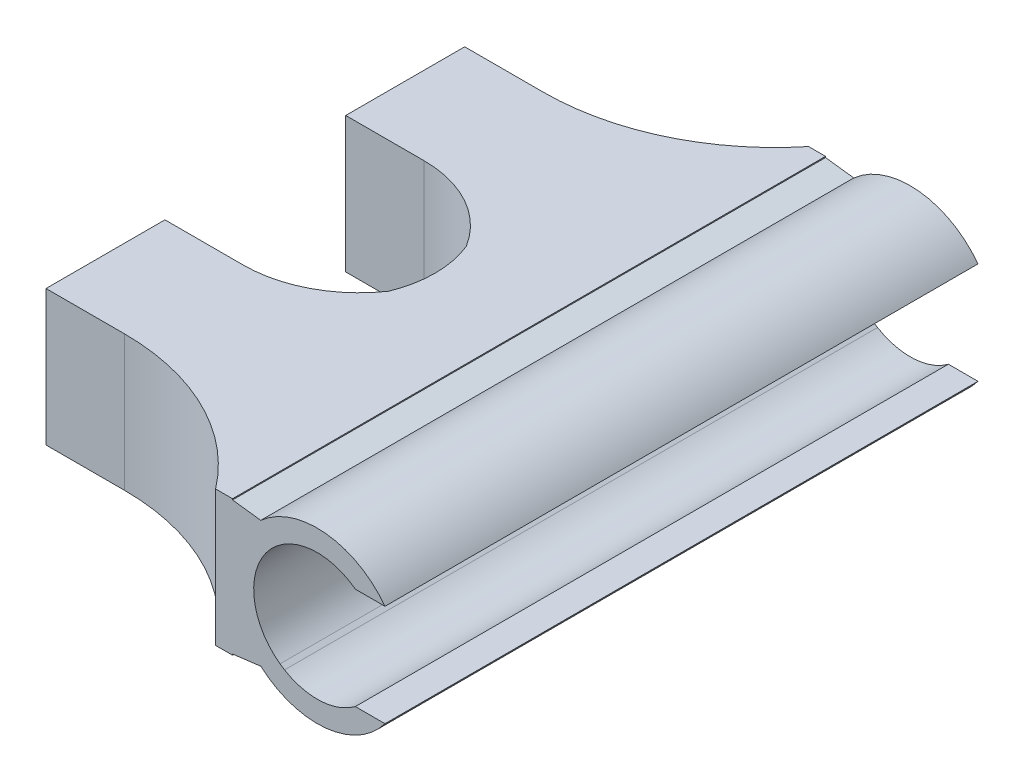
ISO-10303-21;
HEADER;
FILE_DESCRIPTION(('STEP AP214'),'2;1');
FILE_NAME('part.step','',(''),(''),'','','');
FILE_SCHEMA(('AUTOMOTIVE_DESIGN { 1 0 10303 214 1 1 1 1 }'));
ENDSEC;
DATA;
#1=APPLICATION_CONTEXT('core data for automotive mechanical design processes');
#2=APPLICATION_PROTOCOL_DEFINITION('international standard','automotive_design',2000,#1);
#3=PRODUCT_CONTEXT('',#1,'mechanical');
#4=PRODUCT('Part','Part','',(#3));
#5=PRODUCT_RELATED_PRODUCT_CATEGORY('part','',(#4));
#6=PRODUCT_DEFINITION_FORMATION('','',#4);
#7=PRODUCT_DEFINITION_CONTEXT('part definition',#1,'design');
#8=PRODUCT_DEFINITION('design','',#6,#7);
#9=PRODUCT_DEFINITION_SHAPE('','',#8);
#10=(LENGTH_UNIT() NAMED_UNIT(*) SI_UNIT(.MILLI.,.METRE.));
#11=(NAMED_UNIT(*) PLANE_ANGLE_UNIT() SI_UNIT($,.RADIAN.));
#12=(NAMED_UNIT(*) SI_UNIT($,.STERADIAN.) SOLID_ANGLE_UNIT());
#13=UNCERTAINTY_MEASURE_WITH_UNIT(LENGTH_MEASURE(1.E-05),#10,'distance_accuracy_value','');
#14=(GEOMETRIC_REPRESENTATION_CONTEXT(3) GLOBAL_UNCERTAINTY_ASSIGNED_CONTEXT((#13)) GLOBAL_UNIT_ASSIGNED_CONTEXT((#10,
#11,#12)) REPRESENTATION_CONTEXT('',''));
#15=CARTESIAN_POINT('',(0.,0.,0.));
#16=DIRECTION('',(0.,0.,1.));
#17=DIRECTION('',(1.,0.,0.));
#18=AXIS2_PLACEMENT_3D('',#15,#16,#17);
#19=CARTESIAN_POINT('',(-11.,-8.,-17.8885438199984));
#20=DIRECTION('',(0.124034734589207,-0.992277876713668,0.));
#21=DIRECTION('',(0.992277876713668,0.124034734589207,0.));
#22=AXIS2_PLACEMENT_3D('',#19,#20,#21);
#23=PLANE('',#22);
#24=DIRECTION('',(0.992277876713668,0.124034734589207,0.));
#25=VECTOR('',#24,1.);
#26=CARTESIAN_POINT('',(-11.,-8.,70.));
#27=LINE('',#26,#25);
#28=CARTESIAN_POINT('',(-10.,-7.875,70.));
#29=VERTEX_POINT('',#28);
#30=CARTESIAN_POINT('',(-6.66568142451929,-7.45821017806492,70.));
#31=VERTEX_POINT('',#30);
#32=EDGE_CURVE('E269',#29,#31,#27,.T.);
#33=ORIENTED_EDGE('',*,*,#32,.F.);
#34=DIRECTION('',(0.,0.,-1.));
#35=VECTOR('',#34,1.);
#36=CARTESIAN_POINT('',(-10.,-7.875,-17.8885438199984));
#37=LINE('',#36,#35);
#38=CARTESIAN_POINT('',(-10.,-7.875,0.));
#39=VERTEX_POINT('',#38);
#40=EDGE_CURVE('E253',#29,#39,#37,.T.);
#41=ORIENTED_EDGE('',*,*,#40,.T.);
#42=DIRECTION('',(-0.992277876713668,-0.124034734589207,0.));
#43=VECTOR('',#42,1.);
#44=CARTESIAN_POINT('',(-11.,-8.,0.));
#45=LINE('',#44,#43);
#46=CARTESIAN_POINT('',(-6.66568142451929,-7.45821017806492,0.));
#47=VERTEX_POINT('',#46);
#48=EDGE_CURVE('E257',#47,#39,#45,.T.);
#49=ORIENTED_EDGE('',*,*,#48,.F.);
#50=DIRECTION('',(0.,0.,-1.));
#51=VECTOR('',#50,1.);
#52=CARTESIAN_POINT('',(-6.66568142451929,-7.45821017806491,70.));
#53=LINE('',#52,#51);
#54=EDGE_CURVE('E266',#31,#47,#53,.T.);
#55=ORIENTED_EDGE('',*,*,#54,.F.);
#56=EDGE_LOOP('',(#33,#41,#49,#55));
#57=FACE_BOUND('',#56,.T.);
#58=ADVANCED_FACE('F32',(#57),#23,.T.);
#59=CARTESIAN_POINT('',(-3.00000000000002,7.,-17.8885438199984));
#60=DIRECTION('',(0.124034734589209,0.992277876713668,0.));
#61=DIRECTION('',(-0.992277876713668,0.124034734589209,0.));
#62=AXIS2_PLACEMENT_3D('',#59,#60,#61);
#63=PLANE('',#62);
#64=DIRECTION('',(0.992277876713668,-0.124034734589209,0.));
#65=VECTOR('',#64,1.);
#66=CARTESIAN_POINT('',(-3.00000000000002,7.,0.));
#67=LINE('',#66,#65);
#68=CARTESIAN_POINT('',(-10.,7.875,0.));
#69=VERTEX_POINT('',#68);
#70=CARTESIAN_POINT('',(-6.66568142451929,7.45821017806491,0.));
#71=VERTEX_POINT('',#70);
#72=EDGE_CURVE('E264',#69,#71,#67,.T.);
#73=ORIENTED_EDGE('',*,*,#72,.F.);
#74=DIRECTION('',(0.,0.,1.));
#75=VECTOR('',#74,1.);
#76=CARTESIAN_POINT('',(-10.,7.875,-17.8885438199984));
#77=LINE('',#76,#75);
#78=CARTESIAN_POINT('',(-10.,7.875,70.));
#79=VERTEX_POINT('',#78);
#80=EDGE_CURVE('E11',#69,#79,#77,.T.);
#81=ORIENTED_EDGE('',*,*,#80,.T.);
#82=DIRECTION('',(-0.992277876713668,0.124034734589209,0.));
#83=VECTOR('',#82,1.);
#84=CARTESIAN_POINT('',(-3.00000000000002,7.,70.));
#85=LINE('',#84,#83);
#86=CARTESIAN_POINT('',(-6.66568142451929,7.45821017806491,70.));
#87=VERTEX_POINT('',#86);
#88=EDGE_CURVE('E256',#87,#79,#85,.T.);
#89=ORIENTED_EDGE('',*,*,#88,.F.);
#90=DIRECTION('',(0.,0.,-1.));
#91=VECTOR('',#90,1.);
#92=CARTESIAN_POINT('',(-6.66568142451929,7.45821017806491,70.));
#93=LINE('',#92,#91);
#94=EDGE_CURVE('E280',#71,#87,#93,.F.);
#95=ORIENTED_EDGE('',*,*,#94,.F.);
#96=EDGE_LOOP('',(#73,#81,#89,#95));
#97=FACE_BOUND('',#96,.T.);
#98=ADVANCED_FACE('F335',(#97),#63,.T.);
#99=CARTESIAN_POINT('',(-0.00421755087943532,0.,70.));
#100=DIRECTION('',(0.,0.,-1.));
#101=DIRECTION('',(-1.,0.,0.));
#102=AXIS2_PLACEMENT_3D('',#99,#100,#101);
#103=CYLINDRICAL_SURFACE('',#102,7.5);
#104=CARTESIAN_POINT('',(-0.00421755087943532,0.,0.));
#105=DIRECTION('',(0.,0.,-1.));
#106=DIRECTION('',(1.,0.,0.));
#107=AXIS2_PLACEMENT_3D('',#104,#105,#106);
#108=CIRCLE('',#107,7.5);
#109=CARTESIAN_POINT('',(4.49578244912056,-6.,0.));
#110=VERTEX_POINT('',#109);
#111=CARTESIAN_POINT('',(-3.86191590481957,-6.43180871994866,0.));
#112=VERTEX_POINT('',#111);
#113=EDGE_CURVE('E296',#110,#112,#108,.T.);
#114=ORIENTED_EDGE('',*,*,#113,.T.);
#115=DIRECTION('',(0.,0.,-1.));
#116=VECTOR('',#115,1.);
#117=CARTESIAN_POINT('',(-3.86191590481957,-6.43180871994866,70.));
#118=LINE('',#117,#116);
#119=CARTESIAN_POINT('',(-3.86191590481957,-6.43180871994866,70.));
#120=VERTEX_POINT('',#119);
#121=EDGE_CURVE('E278',#112,#120,#118,.F.);
#122=ORIENTED_EDGE('',*,*,#121,.T.);
#123=CARTESIAN_POINT('',(-0.00421755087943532,0.,70.));
#124=DIRECTION('',(0.,0.,-1.));
#125=DIRECTION('',(1.,0.,0.));
#126=AXIS2_PLACEMENT_3D('',#123,#124,#125);
#127=CIRCLE('',#126,7.5);
#128=CARTESIAN_POINT('',(4.49578244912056,-6.,70.));
#129=VERTEX_POINT('',#128);
#130=EDGE_CURVE('E283',#129,#120,#127,.T.);
#131=ORIENTED_EDGE('',*,*,#130,.F.);
#132=DIRECTION('',(0.,0.,-1.));
#133=VECTOR('',#132,1.);
#134=CARTESIAN_POINT('',(4.49578244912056,-6.,70.));
#135=LINE('',#134,#133);
#136=EDGE_CURVE('E295',#129,#110,#135,.T.);
#137=ORIENTED_EDGE('',*,*,#136,.T.);
#138=EDGE_LOOP('',(#114,#122,#131,#137));
#139=FACE_BOUND('',#138,.T.);
#140=ADVANCED_FACE('F348',(#139),#103,.F.);
#141=CARTESIAN_POINT('',(-0.00421755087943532,0.,70.));
#142=DIRECTION('',(0.,0.,-1.));
#143=DIRECTION('',(-1.,0.,0.));
#144=AXIS2_PLACEMENT_3D('',#141,#142,#143);
#145=CYLINDRICAL_SURFACE('',#144,10.);
#146=CARTESIAN_POINT('',(-0.00421755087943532,0.,0.));
#147=DIRECTION('',(0.,0.,1.));
#148=DIRECTION('',(1.,0.,0.));
#149=AXIS2_PLACEMENT_3D('',#146,#147,#148);
#150=CIRCLE('',#149,10.);
#151=CARTESIAN_POINT('',(7.99578244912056,6.,0.));
#152=VERTEX_POINT('',#151);
#153=EDGE_CURVE('E301',#152,#71,#150,.T.);
#154=ORIENTED_EDGE('',*,*,#153,.T.);
#155=ORIENTED_EDGE('',*,*,#94,.T.);
#156=CARTESIAN_POINT('',(-0.00421755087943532,0.,70.));
#157=DIRECTION('',(0.,0.,1.));
#158=DIRECTION('',(1.,0.,0.));
#159=AXIS2_PLACEMENT_3D('',#156,#157,#158);
#160=CIRCLE('',#159,10.);
#161=CARTESIAN_POINT('',(7.99578244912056,6.,70.));
#162=VERTEX_POINT('',#161);
#163=EDGE_CURVE('E290',#162,#87,#160,.T.);
#164=ORIENTED_EDGE('',*,*,#163,.F.);
#165=DIRECTION('',(0.,0.,-1.));
#166=VECTOR('',#165,1.);
#167=CARTESIAN_POINT('',(7.99578244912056,6.,70.));
#168=LINE('',#167,#166);
#169=EDGE_CURVE('E311',#162,#152,#168,.T.);
#170=ORIENTED_EDGE('',*,*,#169,.T.);
#171=EDGE_LOOP('',(#154,#155,#164,#170));
#172=FACE_BOUND('',#171,.T.);
#173=ADVANCED_FACE('F331',(#172),#145,.T.);
#174=CARTESIAN_POINT('',(-4.39485861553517,-6.08048279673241,70.));
#175=VERTEX_POINT('',#174);
#176=CARTESIAN_POINT('',(4.49578244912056,6.,70.));
#177=VERTEX_POINT('',#176);
#178=EDGE_CURVE('E287',#175,#177,#127,.T.);
#179=ORIENTED_EDGE('',*,*,#178,.F.);
#180=DIRECTION('',(0.,0.,-1.));
#181=VECTOR('',#180,1.);
#182=CARTESIAN_POINT('',(-4.39485861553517,-6.08048279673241,70.));
#183=LINE('',#182,#181);
#184=CARTESIAN_POINT('',(-4.39485861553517,-6.08048279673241,0.));
#185=VERTEX_POINT('',#184);
#186=EDGE_CURVE('E275',#175,#185,#183,.T.);
#187=ORIENTED_EDGE('',*,*,#186,.T.);
#188=CARTESIAN_POINT('',(4.49578244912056,6.,0.));
#189=VERTEX_POINT('',#188);
#190=EDGE_CURVE('E282',#185,#189,#108,.T.);
#191=ORIENTED_EDGE('',*,*,#190,.T.);
#192=DIRECTION('',(0.,0.,-1.));
#193=VECTOR('',#192,1.);
#194=CARTESIAN_POINT('',(4.49578244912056,6.,70.));
#195=LINE('',#194,#193);
#196=EDGE_CURVE('E40',#177,#189,#195,.T.);
#197=ORIENTED_EDGE('',*,*,#196,.F.);
#198=EDGE_LOOP('',(#179,#187,#191,#197));
#199=FACE_BOUND('',#198,.T.);
#200=ADVANCED_FACE('F34',(#199),#103,.F.);
#201=CARTESIAN_POINT('',(4.49578244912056,6.,70.));
#202=DIRECTION('',(0.,1.,0.));
#203=DIRECTION('',(-1.,0.,0.));
#204=AXIS2_PLACEMENT_3D('',#201,#202,#203);
#205=PLANE('',#204);
#206=DIRECTION('',(1.,0.,0.));
#207=VECTOR('',#206,1.);
#208=CARTESIAN_POINT('',(4.49578244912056,6.,0.));
#209=LINE('',#208,#207);
#210=EDGE_CURVE('E298',#189,#152,#209,.T.);
#211=ORIENTED_EDGE('',*,*,#210,.T.);
#212=ORIENTED_EDGE('',*,*,#169,.F.);
#213=DIRECTION('',(1.,0.,0.));
#214=VECTOR('',#213,1.);
#215=CARTESIAN_POINT('',(4.49578244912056,6.,70.));
#216=LINE('',#215,#214);
#217=EDGE_CURVE('E286',#177,#162,#216,.T.);
#218=ORIENTED_EDGE('',*,*,#217,.F.);
#219=ORIENTED_EDGE('',*,*,#196,.T.);
#220=EDGE_LOOP('',(#211,#212,#218,#219));
#221=FACE_BOUND('',#220,.T.);
#222=ADVANCED_FACE('F317',(#221),#205,.F.);
#223=CARTESIAN_POINT('',(7.99578244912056,-6.,70.));
#224=VERTEX_POINT('',#223);
#225=EDGE_CURVE('E289',#31,#224,#160,.T.);
#226=ORIENTED_EDGE('',*,*,#225,.F.);
#227=ORIENTED_EDGE('',*,*,#54,.T.);
#228=CARTESIAN_POINT('',(7.99578244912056,-6.,0.));
#229=VERTEX_POINT('',#228);
#230=EDGE_CURVE('E300',#47,#229,#150,.T.);
#231=ORIENTED_EDGE('',*,*,#230,.T.);
#232=DIRECTION('',(0.,0.,-1.));
#233=VECTOR('',#232,1.);
#234=CARTESIAN_POINT('',(7.99578244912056,-6.,70.));
#235=LINE('',#234,#233);
#236=EDGE_CURVE('E308',#224,#229,#235,.T.);
#237=ORIENTED_EDGE('',*,*,#236,.F.);
#238=EDGE_LOOP('',(#226,#227,#231,#237));
#239=FACE_BOUND('',#238,.T.);
#240=ADVANCED_FACE('F356',(#239),#145,.T.);
#241=CARTESIAN_POINT('',(4.49578244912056,-6.,70.));
#242=DIRECTION('',(0.,-1.,0.));
#243=DIRECTION('',(1.,0.,0.));
#244=AXIS2_PLACEMENT_3D('',#241,#242,#243);
#245=PLANE('',#244);
#246=DIRECTION('',(-1.,0.,0.));
#247=VECTOR('',#246,1.);
#248=CARTESIAN_POINT('',(4.49578244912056,-6.,0.));
#249=LINE('',#248,#247);
#250=EDGE_CURVE('E304',#229,#110,#249,.T.);
#251=ORIENTED_EDGE('',*,*,#250,.T.);
#252=ORIENTED_EDGE('',*,*,#136,.F.);
#253=DIRECTION('',(-1.,0.,0.));
#254=VECTOR('',#253,1.);
#255=CARTESIAN_POINT('',(4.49578244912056,-6.,70.));
#256=LINE('',#255,#254);
#257=EDGE_CURVE('E293',#224,#129,#256,.T.);
#258=ORIENTED_EDGE('',*,*,#257,.F.);
#259=ORIENTED_EDGE('',*,*,#236,.T.);
#260=EDGE_LOOP('',(#251,#252,#258,#259));
#261=FACE_BOUND('',#260,.T.);
#262=ADVANCED_FACE('F352',(#261),#245,.F.);
#263=CARTESIAN_POINT('',(-0.00421755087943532,0.,70.));
#264=DIRECTION('',(0.,0.,1.));
#265=DIRECTION('',(1.,0.,0.));
#266=AXIS2_PLACEMENT_3D('',#263,#264,#265);
#267=PLANE('',#266);
#268=DIRECTION('',(0.,1.,0.));
#269=VECTOR('',#268,1.);
#270=CARTESIAN_POINT('',(-10.,-8.,70.));
#271=LINE('',#270,#269);
#272=CARTESIAN_POINT('',(-10.,-8.,70.));
#273=VERTEX_POINT('',#272);
#274=EDGE_CURVE('E244',#273,#29,#271,.T.);
#275=ORIENTED_EDGE('',*,*,#274,.T.);
#276=ORIENTED_EDGE('',*,*,#32,.T.);
#277=ORIENTED_EDGE('',*,*,#225,.T.);
#278=ORIENTED_EDGE('',*,*,#257,.T.);
#279=ORIENTED_EDGE('',*,*,#130,.T.);
#280=DIRECTION('',(-0.834909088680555,0.550387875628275,0.));
#281=VECTOR('',#280,1.);
#282=CARTESIAN_POINT('',(-2.99999999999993,-7.,70.));
#283=LINE('',#282,#281);
#284=EDGE_CURVE('E261',#120,#175,#283,.T.);
#285=ORIENTED_EDGE('',*,*,#284,.T.);
#286=ORIENTED_EDGE('',*,*,#178,.T.);
#287=ORIENTED_EDGE('',*,*,#217,.T.);
#288=ORIENTED_EDGE('',*,*,#163,.T.);
#289=ORIENTED_EDGE('',*,*,#88,.T.);
#290=CARTESIAN_POINT('',(-10.,8.,70.));
#291=VERTEX_POINT('',#290);
#292=EDGE_CURVE('E243',#79,#291,#271,.T.);
#293=ORIENTED_EDGE('',*,*,#292,.T.);
#294=DIRECTION('',(-1.,0.,0.));
#295=VECTOR('',#294,1.);
#296=CARTESIAN_POINT('',(-12.,8.,70.));
#297=LINE('',#296,#295);
#298=CARTESIAN_POINT('',(-12.,8.,70.));
#299=VERTEX_POINT('',#298);
#300=EDGE_CURVE('E403',#291,#299,#297,.T.);
#301=ORIENTED_EDGE('',*,*,#300,.T.);
#302=DIRECTION('',(0.,1.,0.));
#303=VECTOR('',#302,1.);
#304=CARTESIAN_POINT('',(-12.,-8.,70.));
#305=LINE('',#304,#303);
#306=CARTESIAN_POINT('',(-12.,-8.,70.));
#307=VERTEX_POINT('',#306);
#308=EDGE_CURVE('E240',#307,#299,#305,.T.);
#309=ORIENTED_EDGE('',*,*,#308,.F.);
#310=DIRECTION('',(-1.,0.,0.));
#311=VECTOR('',#310,1.);
#312=CARTESIAN_POINT('',(-12.,-8.,70.));
#313=LINE('',#312,#311);
#314=EDGE_CURVE('E366',#273,#307,#313,.T.);
#315=ORIENTED_EDGE('',*,*,#314,.F.);
#316=EDGE_LOOP('',(#275,#276,#277,#278,#279,#285,#286,#287,#288,#289,#293,#301,#309,#315));
#317=FACE_BOUND('',#316,.T.);
#318=ADVANCED_FACE('F338',(#317),#267,.T.);
#319=CARTESIAN_POINT('',(-0.00421755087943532,0.,0.));
#320=DIRECTION('',(0.,0.,1.));
#321=DIRECTION('',(1.,0.,0.));
#322=AXIS2_PLACEMENT_3D('',#319,#320,#321);
#323=PLANE('',#322);
#324=DIRECTION('',(0.,1.,0.));
#325=VECTOR('',#324,1.);
#326=CARTESIAN_POINT('',(-10.,-8.,0.));
#327=LINE('',#326,#325);
#328=CARTESIAN_POINT('',(-10.,-8.,0.));
#329=VERTEX_POINT('',#328);
#330=EDGE_CURVE('E248',#329,#39,#327,.T.);
#331=ORIENTED_EDGE('',*,*,#330,.F.);
#332=DIRECTION('',(1.,0.,0.));
#333=VECTOR('',#332,1.);
#334=CARTESIAN_POINT('',(-10.,-8.,0.));
#335=LINE('',#334,#333);
#336=CARTESIAN_POINT('',(-12.,-8.,0.));
#337=VERTEX_POINT('',#336);
#338=EDGE_CURVE('E375',#337,#329,#335,.T.);
#339=ORIENTED_EDGE('',*,*,#338,.F.);
#340=DIRECTION('',(0.,1.,0.));
#341=VECTOR('',#340,1.);
#342=CARTESIAN_POINT('',(-12.,-8.,0.));
#343=LINE('',#342,#341);
#344=CARTESIAN_POINT('',(-12.,8.,0.));
#345=VERTEX_POINT('',#344);
#346=EDGE_CURVE('E250',#337,#345,#343,.T.);
#347=ORIENTED_EDGE('',*,*,#346,.T.);
#348=DIRECTION('',(1.,0.,0.));
#349=VECTOR('',#348,1.);
#350=CARTESIAN_POINT('',(-10.,8.,0.));
#351=LINE('',#350,#349);
#352=CARTESIAN_POINT('',(-10.,8.,0.));
#353=VERTEX_POINT('',#352);
#354=EDGE_CURVE('E398',#345,#353,#351,.T.);
#355=ORIENTED_EDGE('',*,*,#354,.T.);
#356=EDGE_CURVE('E247',#69,#353,#327,.T.);
#357=ORIENTED_EDGE('',*,*,#356,.F.);
#358=ORIENTED_EDGE('',*,*,#72,.T.);
#359=ORIENTED_EDGE('',*,*,#153,.F.);
#360=ORIENTED_EDGE('',*,*,#210,.F.);
#361=ORIENTED_EDGE('',*,*,#190,.F.);
#362=DIRECTION('',(0.834909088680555,-0.550387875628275,0.));
#363=VECTOR('',#362,1.);
#364=CARTESIAN_POINT('',(-2.99999999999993,-7.,0.));
#365=LINE('',#364,#363);
#366=EDGE_CURVE('E260',#185,#112,#365,.T.);
#367=ORIENTED_EDGE('',*,*,#366,.T.);
#368=ORIENTED_EDGE('',*,*,#113,.F.);
#369=ORIENTED_EDGE('',*,*,#250,.F.);
#370=ORIENTED_EDGE('',*,*,#230,.F.);
#371=ORIENTED_EDGE('',*,*,#48,.T.);
#372=EDGE_LOOP('',(#331,#339,#347,#355,#357,#358,#359,#360,#361,#367,#368,#369,#370,#371));
#373=FACE_BOUND('',#372,.T.);
#374=ADVANCED_FACE('F326',(#373),#323,.F.);
#375=CARTESIAN_POINT('',(-2.99999999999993,-7.,-17.8885438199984));
#376=DIRECTION('',(0.550387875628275,0.834909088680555,0.));
#377=DIRECTION('',(-0.834909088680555,0.550387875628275,0.));
#378=AXIS2_PLACEMENT_3D('',#375,#376,#377);
#379=PLANE('',#378);
#380=ORIENTED_EDGE('',*,*,#121,.F.);
#381=ORIENTED_EDGE('',*,*,#366,.F.);
#382=ORIENTED_EDGE('',*,*,#186,.F.);
#383=ORIENTED_EDGE('',*,*,#284,.F.);
#384=EDGE_LOOP('',(#380,#381,#382,#383));
#385=FACE_BOUND('',#384,.T.);
#386=ADVANCED_FACE('F344',(#385),#379,.T.);
#387=CARTESIAN_POINT('',(-33.2500009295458,-8.,-17.3045811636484));
#388=DIRECTION('',(0.,1.,0.));
#389=DIRECTION('',(0.,0.,1.));
#390=AXIS2_PLACEMENT_3D('',#387,#388,#389);
#391=PLANE('',#390);
#392=DIRECTION('',(-1.,0.,0.));
#393=VECTOR('',#392,1.);
#394=CARTESIAN_POINT('',(-44.4800018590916,-8.,24.14));
#395=LINE('',#394,#393);
#396=CARTESIAN_POINT('',(-33.2500009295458,-8.,24.14));
#397=VERTEX_POINT('',#396);
#398=CARTESIAN_POINT('',(-42.5000018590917,-8.,24.14));
#399=VERTEX_POINT('',#398);
#400=EDGE_CURVE('E392',#397,#399,#395,.T.);
#401=ORIENTED_EDGE('',*,*,#400,.T.);
#402=DIRECTION('',(0.,0.,1.));
#403=VECTOR('',#402,1.);
#404=CARTESIAN_POINT('',(-42.5000018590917,-8.,24.14));
#405=LINE('',#404,#403);
#406=CARTESIAN_POINT('',(-42.5000018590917,-8.,10.1));
#407=VERTEX_POINT('',#406);
#408=EDGE_CURVE('E194',#407,#399,#405,.T.);
#409=ORIENTED_EDGE('',*,*,#408,.F.);
#410=DIRECTION('',(1.,0.,0.));
#411=VECTOR('',#410,1.);
#412=CARTESIAN_POINT('',(-54.5000018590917,-8.,10.1));
#413=LINE('',#412,#411);
#414=CARTESIAN_POINT('',(-33.2500009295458,-8.,10.1));
#415=VERTEX_POINT('',#414);
#416=EDGE_CURVE('E226',#407,#415,#413,.T.);
#417=ORIENTED_EDGE('',*,*,#416,.T.);
#418=CARTESIAN_POINT('',(-33.2500009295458,-8.,-17.3045811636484));
#419=DIRECTION('',(0.,1.,0.));
#420=DIRECTION('',(0.,0.,1.));
#421=AXIS2_PLACEMENT_3D('',#418,#419,#420);
#422=CIRCLE('',#421,27.4045811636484);
#423=EDGE_CURVE('E217',#415,#337,#422,.T.);
#424=ORIENTED_EDGE('',*,*,#423,.T.);
#425=ORIENTED_EDGE('',*,*,#338,.T.);
#426=DIRECTION('',(0.,0.,1.));
#427=VECTOR('',#426,1.);
#428=CARTESIAN_POINT('',(-10.,-8.,70.));
#429=LINE('',#428,#427);
#430=EDGE_CURVE('E371',#329,#273,#429,.T.);
#431=ORIENTED_EDGE('',*,*,#430,.T.);
#432=ORIENTED_EDGE('',*,*,#314,.T.);
#433=CARTESIAN_POINT('',(-33.2500009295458,-8.,86.304014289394));
#434=DIRECTION('',(0.,1.,0.));
#435=DIRECTION('',(0.,0.,-1.));
#436=AXIS2_PLACEMENT_3D('',#433,#434,#435);
#437=CIRCLE('',#436,26.784014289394);
#438=CARTESIAN_POINT('',(-33.2500009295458,-8.,59.52));
#439=VERTEX_POINT('',#438);
#440=EDGE_CURVE('E370',#307,#439,#437,.T.);
#441=ORIENTED_EDGE('',*,*,#440,.T.);
#442=DIRECTION('',(-1.,0.,0.));
#443=VECTOR('',#442,1.);
#444=CARTESIAN_POINT('',(-44.48,-8.,59.52));
#445=LINE('',#444,#443);
#446=CARTESIAN_POINT('',(-42.5000018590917,-8.,59.52));
#447=VERTEX_POINT('',#446);
#448=EDGE_CURVE('E381',#439,#447,#445,.T.);
#449=ORIENTED_EDGE('',*,*,#448,.T.);
#450=DIRECTION('',(0.,0.,1.));
#451=VECTOR('',#450,1.);
#452=CARTESIAN_POINT('',(-42.5000018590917,-8.,45.48));
#453=LINE('',#452,#451);
#454=CARTESIAN_POINT('',(-42.5000018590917,-8.,45.48));
#455=VERTEX_POINT('',#454);
#456=EDGE_CURVE('E199',#455,#447,#453,.T.);
#457=ORIENTED_EDGE('',*,*,#456,.F.);
#458=DIRECTION('',(1.,0.,0.));
#459=VECTOR('',#458,1.);
#460=CARTESIAN_POINT('',(-54.5,-8.,45.48));
#461=LINE('',#460,#459);
#462=CARTESIAN_POINT('',(-33.2500009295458,-8.,45.48));
#463=VERTEX_POINT('',#462);
#464=EDGE_CURVE('E384',#455,#463,#461,.T.);
#465=ORIENTED_EDGE('',*,*,#464,.T.);
#466=CARTESIAN_POINT('',(-33.2500009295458,-8.,31.797072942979));
#467=DIRECTION('',(0.,1.,0.));
#468=DIRECTION('',(0.,0.,1.));
#469=AXIS2_PLACEMENT_3D('',#466,#467,#468);
#470=CIRCLE('',#469,13.682927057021);
#471=CARTESIAN_POINT('',(-22.0000000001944,-8.,39.5855241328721));
#472=VERTEX_POINT('',#471);
#473=EDGE_CURVE('E386',#463,#472,#470,.T.);
#474=ORIENTED_EDGE('',*,*,#473,.T.);
#475=CARTESIAN_POINT('',(-33.25,-8.,35.));
#476=DIRECTION('',(0.,1.,0.));
#477=DIRECTION('',(0.,0.,-1.));
#478=AXIS2_PLACEMENT_3D('',#475,#476,#477);
#479=CIRCLE('',#478,12.1486431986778);
#480=CARTESIAN_POINT('',(-21.9999999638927,-8.,30.4144759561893));
#481=VERTEX_POINT('',#480);
#482=EDGE_CURVE('E388',#472,#481,#479,.T.);
#483=ORIENTED_EDGE('',*,*,#482,.T.);
#484=CARTESIAN_POINT('',(-33.2500009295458,-8.,37.362743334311));
#485=DIRECTION('',(0.,1.,0.));
#486=DIRECTION('',(0.,0.,-1.));
#487=AXIS2_PLACEMENT_3D('',#484,#485,#486);
#488=CIRCLE('',#487,13.222743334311);
#489=EDGE_CURVE('E390',#481,#397,#488,.T.);
#490=ORIENTED_EDGE('',*,*,#489,.T.);
#491=EDGE_LOOP('',(#401,#409,#417,#424,#425,#431,#432,#441,#449,#457,#465,#474,#483,#490));
#492=FACE_BOUND('',#491,.T.);
#493=ADVANCED_FACE('F373',(#492),#391,.F.);
#494=CARTESIAN_POINT('',(-10.,-8.,70.));
#495=DIRECTION('',(-1.,0.,0.));
#496=DIRECTION('',(0.,0.,1.));
#497=AXIS2_PLACEMENT_3D('',#494,#495,#496);
#498=PLANE('',#497);
#499=ORIENTED_EDGE('',*,*,#40,.F.);
#500=ORIENTED_EDGE('',*,*,#274,.F.);
#501=ORIENTED_EDGE('',*,*,#430,.F.);
#502=ORIENTED_EDGE('',*,*,#330,.T.);
#503=EDGE_LOOP('',(#499,#500,#501,#502));
#504=FACE_BOUND('',#503,.T.);
#505=ADVANCED_FACE('F364',(#504),#498,.F.);
#506=CARTESIAN_POINT('',(-33.2500009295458,8.,-17.3045811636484));
#507=DIRECTION('',(0.,1.,0.));
#508=DIRECTION('',(0.,0.,1.));
#509=AXIS2_PLACEMENT_3D('',#506,#507,#508);
#510=PLANE('',#509);
#511=DIRECTION('',(0.,0.,1.));
#512=VECTOR('',#511,1.);
#513=CARTESIAN_POINT('',(-42.5000018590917,8.,24.14));
#514=LINE('',#513,#512);
#515=CARTESIAN_POINT('',(-42.5000018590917,8.,10.1));
#516=VERTEX_POINT('',#515);
#517=CARTESIAN_POINT('',(-42.5000018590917,8.,24.14));
#518=VERTEX_POINT('',#517);
#519=EDGE_CURVE('E47',#516,#518,#514,.T.);
#520=ORIENTED_EDGE('',*,*,#519,.T.);
#521=DIRECTION('',(-1.,0.,0.));
#522=VECTOR('',#521,1.);
#523=CARTESIAN_POINT('',(-54.5000018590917,8.,24.14));
#524=LINE('',#523,#522);
#525=CARTESIAN_POINT('',(-33.2500009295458,8.,24.14));
#526=VERTEX_POINT('',#525);
#527=EDGE_CURVE('E206',#526,#518,#524,.T.);
#528=ORIENTED_EDGE('',*,*,#527,.F.);
#529=CARTESIAN_POINT('',(-33.2500009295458,8.,37.362743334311));
#530=DIRECTION('',(0.,1.,0.));
#531=DIRECTION('',(0.,0.,-1.));
#532=AXIS2_PLACEMENT_3D('',#529,#530,#531);
#533=CIRCLE('',#532,13.222743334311);
#534=CARTESIAN_POINT('',(-21.9999999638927,8.,30.4144759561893));
#535=VERTEX_POINT('',#534);
#536=EDGE_CURVE('E215',#535,#526,#533,.T.);
#537=ORIENTED_EDGE('',*,*,#536,.F.);
#538=CARTESIAN_POINT('',(-33.25,8.,35.));
#539=DIRECTION('',(0.,1.,0.));
#540=DIRECTION('',(0.,0.,-1.));
#541=AXIS2_PLACEMENT_3D('',#538,#539,#540);
#542=CIRCLE('',#541,12.1486431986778);
#543=CARTESIAN_POINT('',(-22.0000000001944,8.,39.5855241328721));
#544=VERTEX_POINT('',#543);
#545=EDGE_CURVE('E219',#544,#535,#542,.T.);
#546=ORIENTED_EDGE('',*,*,#545,.F.);
#547=CARTESIAN_POINT('',(-33.2500009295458,8.,31.797072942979));
#548=DIRECTION('',(0.,1.,0.));
#549=DIRECTION('',(0.,0.,1.));
#550=AXIS2_PLACEMENT_3D('',#547,#548,#549);
#551=CIRCLE('',#550,13.682927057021);
#552=CARTESIAN_POINT('',(-33.2500009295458,8.,45.48));
#553=VERTEX_POINT('',#552);
#554=EDGE_CURVE('E413',#553,#544,#551,.T.);
#555=ORIENTED_EDGE('',*,*,#554,.F.);
#556=DIRECTION('',(1.,0.,0.));
#557=VECTOR('',#556,1.);
#558=CARTESIAN_POINT('',(-44.48,8.,45.48));
#559=LINE('',#558,#557);
#560=CARTESIAN_POINT('',(-42.5000018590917,8.,45.48));
#561=VERTEX_POINT('',#560);
#562=EDGE_CURVE('E411',#561,#553,#559,.T.);
#563=ORIENTED_EDGE('',*,*,#562,.F.);
#564=DIRECTION('',(0.,0.,1.));
#565=VECTOR('',#564,1.);
#566=CARTESIAN_POINT('',(-42.5000018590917,8.,45.48));
#567=LINE('',#566,#565);
#568=CARTESIAN_POINT('',(-42.5000018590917,8.,59.52));
#569=VERTEX_POINT('',#568);
#570=EDGE_CURVE('E55',#561,#569,#567,.T.);
#571=ORIENTED_EDGE('',*,*,#570,.T.);
#572=DIRECTION('',(-1.,0.,0.));
#573=VECTOR('',#572,1.);
#574=CARTESIAN_POINT('',(-54.5,8.,59.52));
#575=LINE('',#574,#573);
#576=CARTESIAN_POINT('',(-33.2500009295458,8.,59.52));
#577=VERTEX_POINT('',#576);
#578=EDGE_CURVE('E408',#577,#569,#575,.T.);
#579=ORIENTED_EDGE('',*,*,#578,.F.);
#580=CARTESIAN_POINT('',(-33.2500009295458,8.,86.304014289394));
#581=DIRECTION('',(0.,1.,0.));
#582=DIRECTION('',(0.,0.,-1.));
#583=AXIS2_PLACEMENT_3D('',#580,#581,#582);
#584=CIRCLE('',#583,26.784014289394);
#585=EDGE_CURVE('E405',#299,#577,#584,.T.);
#586=ORIENTED_EDGE('',*,*,#585,.F.);
#587=ORIENTED_EDGE('',*,*,#300,.F.);
#588=DIRECTION('',(0.,0.,1.));
#589=VECTOR('',#588,1.);
#590=CARTESIAN_POINT('',(-10.,8.,70.));
#591=LINE('',#590,#589);
#592=EDGE_CURVE('E401',#353,#291,#591,.T.);
#593=ORIENTED_EDGE('',*,*,#592,.F.);
#594=ORIENTED_EDGE('',*,*,#354,.F.);
#595=CARTESIAN_POINT('',(-33.2500009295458,8.,-17.3045811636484));
#596=DIRECTION('',(0.,1.,0.));
#597=DIRECTION('',(0.,0.,1.));
#598=AXIS2_PLACEMENT_3D('',#595,#596,#597);
#599=CIRCLE('',#598,27.4045811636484);
#600=CARTESIAN_POINT('',(-33.2500009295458,8.,10.1));
#601=VERTEX_POINT('',#600);
#602=EDGE_CURVE('E395',#601,#345,#599,.T.);
#603=ORIENTED_EDGE('',*,*,#602,.F.);
#604=DIRECTION('',(1.,0.,0.));
#605=VECTOR('',#604,1.);
#606=CARTESIAN_POINT('',(-44.5583859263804,8.,10.1));
#607=LINE('',#606,#605);
#608=EDGE_CURVE('E209',#516,#601,#607,.T.);
#609=ORIENTED_EDGE('',*,*,#608,.F.);
#610=EDGE_LOOP('',(#520,#528,#537,#546,#555,#563,#571,#579,#586,#587,#593,#594,#603,#609));
#611=FACE_BOUND('',#610,.T.);
#612=ADVANCED_FACE('F204',(#611),#510,.T.);
#613=CARTESIAN_POINT('',(-33.2500009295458,-8.,-17.3045811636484));
#614=DIRECTION('',(0.,1.,0.));
#615=DIRECTION('',(0.,0.,1.));
#616=AXIS2_PLACEMENT_3D('',#613,#614,#615);
#617=CYLINDRICAL_SURFACE('',#616,27.4045811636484);
#618=ORIENTED_EDGE('',*,*,#602,.T.);
#619=ORIENTED_EDGE('',*,*,#346,.F.);
#620=ORIENTED_EDGE('',*,*,#423,.F.);
#621=DIRECTION('',(0.,1.,0.));
#622=VECTOR('',#621,1.);
#623=CARTESIAN_POINT('',(-33.2500009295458,-8.,10.1));
#624=LINE('',#623,#622);
#625=EDGE_CURVE('E223',#415,#601,#624,.T.);
#626=ORIENTED_EDGE('',*,*,#625,.T.);
#627=EDGE_LOOP('',(#618,#619,#620,#626));
#628=FACE_BOUND('',#627,.T.);
#629=ADVANCED_FACE('F444',(#628),#617,.F.);
#630=ORIENTED_EDGE('',*,*,#80,.F.);
#631=ORIENTED_EDGE('',*,*,#356,.T.);
#632=ORIENTED_EDGE('',*,*,#592,.T.);
#633=ORIENTED_EDGE('',*,*,#292,.F.);
#634=EDGE_LOOP('',(#630,#631,#632,#633));
#635=FACE_BOUND('',#634,.T.);
#636=ADVANCED_FACE('F448',(#635),#498,.F.);
#637=CARTESIAN_POINT('',(-33.2500009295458,-8.,86.304014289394));
#638=DIRECTION('',(0.,1.,0.));
#639=DIRECTION('',(0.,0.,1.));
#640=AXIS2_PLACEMENT_3D('',#637,#638,#639);
#641=CYLINDRICAL_SURFACE('',#640,26.784014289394);
#642=ORIENTED_EDGE('',*,*,#585,.T.);
#643=DIRECTION('',(0.,1.,0.));
#644=VECTOR('',#643,1.);
#645=CARTESIAN_POINT('',(-33.2500009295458,-8.,59.52));
#646=LINE('',#645,#644);
#647=EDGE_CURVE('E237',#439,#577,#646,.T.);
#648=ORIENTED_EDGE('',*,*,#647,.F.);
#649=ORIENTED_EDGE('',*,*,#440,.F.);
#650=ORIENTED_EDGE('',*,*,#308,.T.);
#651=EDGE_LOOP('',(#642,#648,#649,#650));
#652=FACE_BOUND('',#651,.T.);
#653=ADVANCED_FACE('F451',(#652),#641,.F.);
#654=CARTESIAN_POINT('',(-54.5,-8.,59.52));
#655=DIRECTION('',(0.,0.,-1.));
#656=DIRECTION('',(-1.,0.,0.));
#657=AXIS2_PLACEMENT_3D('',#654,#655,#656);
#658=PLANE('',#657);
#659=ORIENTED_EDGE('',*,*,#578,.T.);
#660=DIRECTION('',(0.,-1.,0.));
#661=VECTOR('',#660,1.);
#662=CARTESIAN_POINT('',(-42.5000018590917,8.,59.52));
#663=LINE('',#662,#661);
#664=EDGE_CURVE('E399',#569,#447,#663,.T.);
#665=ORIENTED_EDGE('',*,*,#664,.T.);
#666=ORIENTED_EDGE('',*,*,#448,.F.);
#667=ORIENTED_EDGE('',*,*,#647,.T.);
#668=EDGE_LOOP('',(#659,#665,#666,#667));
#669=FACE_BOUND('',#668,.T.);
#670=ADVANCED_FACE('F455',(#669),#658,.F.);
#671=CARTESIAN_POINT('',(-44.48,-8.,45.48));
#672=DIRECTION('',(0.,0.,1.));
#673=DIRECTION('',(1.,0.,0.));
#674=AXIS2_PLACEMENT_3D('',#671,#672,#673);
#675=PLANE('',#674);
#676=ORIENTED_EDGE('',*,*,#464,.F.);
#677=DIRECTION('',(0.,-1.,0.));
#678=VECTOR('',#677,1.);
#679=CARTESIAN_POINT('',(-42.5000018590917,8.,45.48));
#680=LINE('',#679,#678);
#681=EDGE_CURVE('E433',#561,#455,#680,.T.);
#682=ORIENTED_EDGE('',*,*,#681,.F.);
#683=ORIENTED_EDGE('',*,*,#562,.T.);
#684=DIRECTION('',(0.,1.,0.));
#685=VECTOR('',#684,1.);
#686=CARTESIAN_POINT('',(-33.2500009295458,-8.,45.48));
#687=LINE('',#686,#685);
#688=EDGE_CURVE('E234',#463,#553,#687,.T.);
#689=ORIENTED_EDGE('',*,*,#688,.F.);
#690=EDGE_LOOP('',(#676,#682,#683,#689));
#691=FACE_BOUND('',#690,.T.);
#692=ADVANCED_FACE('F432',(#691),#675,.F.);
#693=CARTESIAN_POINT('',(-33.2500009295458,-8.,31.797072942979));
#694=DIRECTION('',(0.,1.,0.));
#695=DIRECTION('',(0.,0.,1.));
#696=AXIS2_PLACEMENT_3D('',#693,#694,#695);
#697=CYLINDRICAL_SURFACE('',#696,13.682927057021);
#698=ORIENTED_EDGE('',*,*,#554,.T.);
#699=DIRECTION('',(0.,1.,0.));
#700=VECTOR('',#699,1.);
#701=CARTESIAN_POINT('',(-22.0000000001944,-8.,39.5855241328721));
#702=LINE('',#701,#700);
#703=EDGE_CURVE('E231',#472,#544,#702,.T.);
#704=ORIENTED_EDGE('',*,*,#703,.F.);
#705=ORIENTED_EDGE('',*,*,#473,.F.);
#706=ORIENTED_EDGE('',*,*,#688,.T.);
#707=EDGE_LOOP('',(#698,#704,#705,#706));
#708=FACE_BOUND('',#707,.T.);
#709=ADVANCED_FACE('F429',(#708),#697,.F.);
#710=CARTESIAN_POINT('',(-33.25,-8.,35.));
#711=DIRECTION('',(0.,1.,0.));
#712=DIRECTION('',(0.,0.,1.));
#713=AXIS2_PLACEMENT_3D('',#710,#711,#712);
#714=CYLINDRICAL_SURFACE('',#713,12.1486431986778);
#715=ORIENTED_EDGE('',*,*,#545,.T.);
#716=DIRECTION('',(0.,1.,0.));
#717=VECTOR('',#716,1.);
#718=CARTESIAN_POINT('',(-21.9999999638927,-8.,30.4144759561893));
#719=LINE('',#718,#717);
#720=EDGE_CURVE('E228',#481,#535,#719,.T.);
#721=ORIENTED_EDGE('',*,*,#720,.F.);
#722=ORIENTED_EDGE('',*,*,#482,.F.);
#723=ORIENTED_EDGE('',*,*,#703,.T.);
#724=EDGE_LOOP('',(#715,#721,#722,#723));
#725=FACE_BOUND('',#724,.T.);
#726=ADVANCED_FACE('F417',(#725),#714,.F.);
#727=CARTESIAN_POINT('',(-33.2500009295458,-8.,37.362743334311));
#728=DIRECTION('',(0.,1.,0.));
#729=DIRECTION('',(0.,0.,1.));
#730=AXIS2_PLACEMENT_3D('',#727,#728,#729);
#731=CYLINDRICAL_SURFACE('',#730,13.222743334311);
#732=ORIENTED_EDGE('',*,*,#536,.T.);
#733=DIRECTION('',(0.,1.,0.));
#734=VECTOR('',#733,1.);
#735=CARTESIAN_POINT('',(-33.2500009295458,-8.,24.14));
#736=LINE('',#735,#734);
#737=EDGE_CURVE('E214',#397,#526,#736,.T.);
#738=ORIENTED_EDGE('',*,*,#737,.F.);
#739=ORIENTED_EDGE('',*,*,#489,.F.);
#740=ORIENTED_EDGE('',*,*,#720,.T.);
#741=EDGE_LOOP('',(#732,#738,#739,#740));
#742=FACE_BOUND('',#741,.T.);
#743=ADVANCED_FACE('F423',(#742),#731,.F.);
#744=CARTESIAN_POINT('',(-54.5000018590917,-8.,24.14));
#745=DIRECTION('',(0.,0.,-1.));
#746=DIRECTION('',(-1.,0.,0.));
#747=AXIS2_PLACEMENT_3D('',#744,#745,#746);
#748=PLANE('',#747);
#749=ORIENTED_EDGE('',*,*,#527,.T.);
#750=DIRECTION('',(0.,-1.,0.));
#751=VECTOR('',#750,1.);
#752=CARTESIAN_POINT('',(-42.5000018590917,8.,24.14));
#753=LINE('',#752,#751);
#754=EDGE_CURVE('E191',#518,#399,#753,.T.);
#755=ORIENTED_EDGE('',*,*,#754,.T.);
#756=ORIENTED_EDGE('',*,*,#400,.F.);
#757=ORIENTED_EDGE('',*,*,#737,.T.);
#758=EDGE_LOOP('',(#749,#755,#756,#757));
#759=FACE_BOUND('',#758,.T.);
#760=ADVANCED_FACE('F212',(#759),#748,.F.);
#761=CARTESIAN_POINT('',(-44.5583859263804,-8.,10.1));
#762=DIRECTION('',(0.,0.,1.));
#763=DIRECTION('',(1.,0.,0.));
#764=AXIS2_PLACEMENT_3D('',#761,#762,#763);
#765=PLANE('',#764);
#766=ORIENTED_EDGE('',*,*,#416,.F.);
#767=DIRECTION('',(0.,-1.,0.));
#768=VECTOR('',#767,1.);
#769=CARTESIAN_POINT('',(-42.5000018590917,8.,10.1));
#770=LINE('',#769,#768);
#771=EDGE_CURVE('E200',#516,#407,#770,.T.);
#772=ORIENTED_EDGE('',*,*,#771,.F.);
#773=ORIENTED_EDGE('',*,*,#608,.T.);
#774=ORIENTED_EDGE('',*,*,#625,.F.);
#775=EDGE_LOOP('',(#766,#772,#773,#774));
#776=FACE_BOUND('',#775,.T.);
#777=ADVANCED_FACE('F460',(#776),#765,.F.);
#778=CARTESIAN_POINT('',(-42.5000018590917,8.,45.48));
#779=DIRECTION('',(1.,0.,0.));
#780=DIRECTION('',(0.,0.,-1.));
#781=AXIS2_PLACEMENT_3D('',#778,#779,#780);
#782=PLANE('',#781);
#783=ORIENTED_EDGE('',*,*,#456,.T.);
#784=ORIENTED_EDGE('',*,*,#664,.F.);
#785=ORIENTED_EDGE('',*,*,#570,.F.);
#786=ORIENTED_EDGE('',*,*,#681,.T.);
#787=EDGE_LOOP('',(#783,#784,#785,#786));
#788=FACE_BOUND('',#787,.T.);
#789=ADVANCED_FACE('F456',(#788),#782,.F.);
#790=CARTESIAN_POINT('',(-42.5000018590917,8.,24.14));
#791=DIRECTION('',(1.,0.,0.));
#792=DIRECTION('',(0.,0.,-1.));
#793=AXIS2_PLACEMENT_3D('',#790,#791,#792);
#794=PLANE('',#793);
#795=ORIENTED_EDGE('',*,*,#408,.T.);
#796=ORIENTED_EDGE('',*,*,#754,.F.);
#797=ORIENTED_EDGE('',*,*,#519,.F.);
#798=ORIENTED_EDGE('',*,*,#771,.T.);
#799=EDGE_LOOP('',(#795,#796,#797,#798));
#800=FACE_BOUND('',#799,.T.);
#801=ADVANCED_FACE('F192',(#800),#794,.F.);
#802=CLOSED_SHELL('',(#58,#98,#140,#173,#200,#222,#240,#262,#318,#374,#386,#493,#505,#612,#629,
#636,#653,#670,#692,#709,#726,#743,#760,#777,#789,#801));
#803=MANIFOLD_SOLID_BREP('B2',#802);
#804=ADVANCED_BREP_SHAPE_REPRESENTATION('',(#18,#803),#14);
#805=SHAPE_DEFINITION_REPRESENTATION(#9,#804);
ENDSEC;
END-ISO-10303-21;
